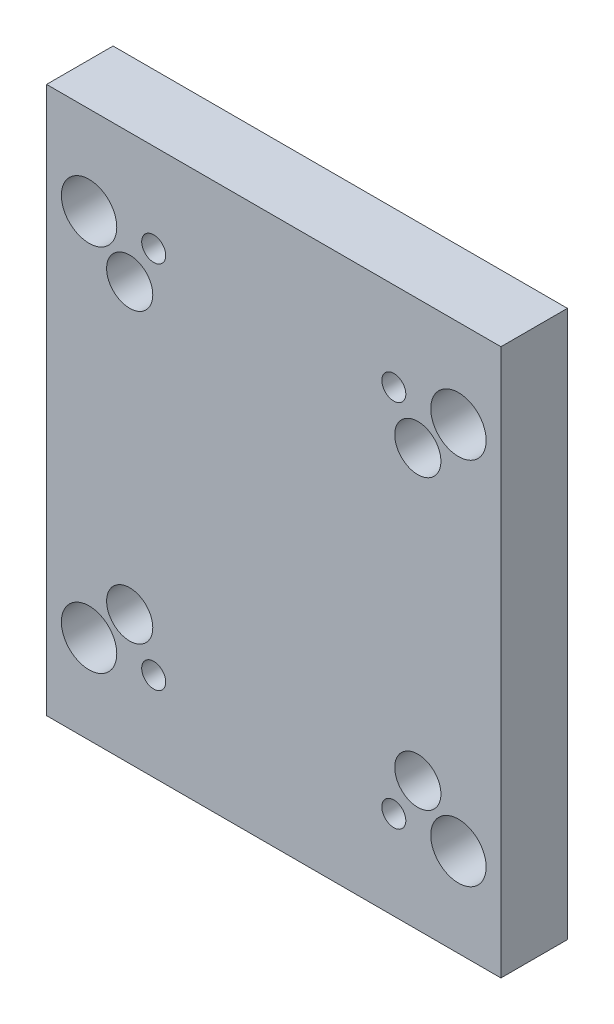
ISO-10303-21;
HEADER;
FILE_DESCRIPTION(('STEP AP214'),'2;1');
FILE_NAME('part.step','',(''),(''),'','','');
FILE_SCHEMA(('AUTOMOTIVE_DESIGN { 1 0 10303 214 1 1 1 1 }'));
ENDSEC;
DATA;
#1=APPLICATION_CONTEXT('core data for automotive mechanical design processes');
#2=APPLICATION_PROTOCOL_DEFINITION('international standard','automotive_design',2000,#1);
#3=PRODUCT_CONTEXT('',#1,'mechanical');
#4=PRODUCT('Part','Part','',(#3));
#5=PRODUCT_RELATED_PRODUCT_CATEGORY('part','',(#4));
#6=PRODUCT_DEFINITION_FORMATION('','',#4);
#7=PRODUCT_DEFINITION_CONTEXT('part definition',#1,'design');
#8=PRODUCT_DEFINITION('design','',#6,#7);
#9=PRODUCT_DEFINITION_SHAPE('','',#8);
#10=(LENGTH_UNIT() NAMED_UNIT(*) SI_UNIT(.MILLI.,.METRE.));
#11=(NAMED_UNIT(*) PLANE_ANGLE_UNIT() SI_UNIT($,.RADIAN.));
#12=(NAMED_UNIT(*) SI_UNIT($,.STERADIAN.) SOLID_ANGLE_UNIT());
#13=UNCERTAINTY_MEASURE_WITH_UNIT(LENGTH_MEASURE(1.E-05),#10,'distance_accuracy_value','');
#14=(GEOMETRIC_REPRESENTATION_CONTEXT(3) GLOBAL_UNCERTAINTY_ASSIGNED_CONTEXT((#13)) GLOBAL_UNIT_ASSIGNED_CONTEXT((#10,
#11,#12)) REPRESENTATION_CONTEXT('',''));
#15=CARTESIAN_POINT('',(0.,0.,0.));
#16=DIRECTION('',(0.,0.,1.));
#17=DIRECTION('',(1.,0.,0.));
#18=AXIS2_PLACEMENT_3D('',#15,#16,#17);
#19=CARTESIAN_POINT('',(0.,-128.,27.9999999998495));
#20=DIRECTION('',(0.,0.,-1.));
#21=DIRECTION('',(-1.,0.,0.));
#22=AXIS2_PLACEMENT_3D('',#19,#20,#21);
#23=CONICAL_SURFACE('',#22,2.45850000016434,1.04719755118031);
#24=CARTESIAN_POINT('',(0.,-128.,28.));
#25=DIRECTION('',(0.,0.,1.));
#26=DIRECTION('',(1.,0.,0.));
#27=AXIS2_PLACEMENT_3D('',#24,#25,#26);
#28=CIRCLE('',#27,2.4585);
#29=CARTESIAN_POINT('',(2.45849999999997,-128.,28.));
#30=VERTEX_POINT('',#29);
#31=EDGE_CURVE('E152',#30,#30,#28,.F.);
#32=ORIENTED_EDGE('',*,*,#31,.T.);
#33=EDGE_LOOP('',(#32));
#34=FACE_BOUND('',#33,.T.);
#35=CARTESIAN_POINT('',(8.52384793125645E-11,-127.999999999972,29.4194156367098));
#36=VERTEX_POINT('',#35);
#37=VERTEX_LOOP('',#36);
#38=FACE_BOUND('',#37,.T.);
#39=ADVANCED_FACE('F16',(#34,#38),#23,.F.);
#40=CARTESIAN_POINT('',(-103.,0.,28.0000000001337));
#41=DIRECTION('',(0.,0.,-1.));
#42=DIRECTION('',(0.,1.,0.));
#43=AXIS2_PLACEMENT_3D('',#40,#41,#42);
#44=CONICAL_SURFACE('',#43,2.45849999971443,1.04719755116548);
#45=CARTESIAN_POINT('',(-103.,0.,28.));
#46=DIRECTION('',(0.,0.,1.));
#47=DIRECTION('',(1.,0.,0.));
#48=AXIS2_PLACEMENT_3D('',#45,#46,#47);
#49=CIRCLE('',#48,2.4585);
#50=CARTESIAN_POINT('',(-100.5415,0.,28.));
#51=VERTEX_POINT('',#50);
#52=EDGE_CURVE('E149',#51,#51,#49,.F.);
#53=ORIENTED_EDGE('',*,*,#52,.T.);
#54=EDGE_LOOP('',(#53));
#55=FACE_BOUND('',#54,.T.);
#56=CARTESIAN_POINT('',(-103.,0.,29.4194156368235));
#57=VERTEX_POINT('',#56);
#58=VERTEX_LOOP('',#57);
#59=FACE_BOUND('',#58,.T.);
#60=ADVANCED_FACE('F62',(#55,#59),#44,.F.);
#61=CARTESIAN_POINT('',(103.,0.,28.0000000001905));
#62=DIRECTION('',(0.,0.,-1.));
#63=DIRECTION('',(-1.,0.,0.));
#64=AXIS2_PLACEMENT_3D('',#61,#62,#63);
#65=CONICAL_SURFACE('',#64,2.45849999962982,1.04719755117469);
#66=CARTESIAN_POINT('',(103.,0.,28.));
#67=DIRECTION('',(0.,0.,1.));
#68=DIRECTION('',(1.,0.,0.));
#69=AXIS2_PLACEMENT_3D('',#66,#67,#68);
#70=CIRCLE('',#69,2.4585);
#71=CARTESIAN_POINT('',(105.4585,0.,28.));
#72=VERTEX_POINT('',#71);
#73=EDGE_CURVE('E146',#72,#72,#70,.F.);
#74=ORIENTED_EDGE('',*,*,#73,.T.);
#75=EDGE_LOOP('',(#74));
#76=FACE_BOUND('',#75,.T.);
#77=CARTESIAN_POINT('',(103.,0.,29.4194156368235));
#78=VERTEX_POINT('',#77);
#79=VERTEX_LOOP('',#78);
#80=FACE_BOUND('',#79,.T.);
#81=ADVANCED_FACE('F69',(#76,#80),#65,.F.);
#82=CARTESIAN_POINT('',(0.,128.,27.9999999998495));
#83=DIRECTION('',(0.,0.,-1.));
#84=DIRECTION('',(-1.,0.,0.));
#85=AXIS2_PLACEMENT_3D('',#82,#83,#84);
#86=CONICAL_SURFACE('',#85,2.45850000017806,1.04719755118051);
#87=CARTESIAN_POINT('',(0.,128.,28.));
#88=DIRECTION('',(0.,0.,1.));
#89=DIRECTION('',(1.,0.,0.));
#90=AXIS2_PLACEMENT_3D('',#87,#88,#89);
#91=CIRCLE('',#90,2.4585);
#92=CARTESIAN_POINT('',(2.45849999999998,128.,28.));
#93=VERTEX_POINT('',#92);
#94=EDGE_CURVE('E143',#93,#93,#91,.F.);
#95=ORIENTED_EDGE('',*,*,#94,.T.);
#96=EDGE_LOOP('',(#95));
#97=FACE_BOUND('',#96,.T.);
#98=CARTESIAN_POINT('',(0.,128.,29.4194156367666));
#99=VERTEX_POINT('',#98);
#100=VERTEX_LOOP('',#99);
#101=FACE_BOUND('',#100,.T.);
#102=ADVANCED_FACE('F383',(#97,#101),#86,.F.);
#103=CARTESIAN_POINT('',(0.,-128.,0.1));
#104=DIRECTION('',(0.,0.,1.));
#105=DIRECTION('',(1.,0.,0.));
#106=AXIS2_PLACEMENT_3D('',#103,#104,#105);
#107=CYLINDRICAL_SURFACE('',#106,2.4585);
#108=ORIENTED_EDGE('',*,*,#31,.F.);
#109=EDGE_LOOP('',(#108));
#110=FACE_BOUND('',#109,.T.);
#111=CARTESIAN_POINT('',(0.,-128.,0.));
#112=DIRECTION('',(0.,0.,1.));
#113=DIRECTION('',(1.,0.,0.));
#114=AXIS2_PLACEMENT_3D('',#111,#112,#113);
#115=CIRCLE('',#114,2.4585);
#116=CARTESIAN_POINT('',(2.45849999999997,-128.,0.));
#117=VERTEX_POINT('',#116);
#118=EDGE_CURVE('E222',#117,#117,#115,.F.);
#119=ORIENTED_EDGE('',*,*,#118,.T.);
#120=EDGE_LOOP('',(#119));
#121=FACE_BOUND('',#120,.T.);
#122=ADVANCED_FACE('F381',(#110,#121),#107,.F.);
#123=CARTESIAN_POINT('',(-65.,100.,0.1));
#124=DIRECTION('',(0.,0.,1.));
#125=DIRECTION('',(1.,0.,0.));
#126=AXIS2_PLACEMENT_3D('',#123,#124,#125);
#127=CYLINDRICAL_SURFACE('',#126,10.);
#128=CARTESIAN_POINT('',(-65.,100.,15.5));
#129=DIRECTION('',(0.,0.,1.));
#130=DIRECTION('',(1.,0.,0.));
#131=AXIS2_PLACEMENT_3D('',#128,#129,#130);
#132=CIRCLE('',#131,10.);
#133=CARTESIAN_POINT('',(-55.,100.,15.5));
#134=VERTEX_POINT('',#133);
#135=EDGE_CURVE('E20',#134,#134,#132,.T.);
#136=ORIENTED_EDGE('',*,*,#135,.T.);
#137=EDGE_LOOP('',(#136));
#138=FACE_BOUND('',#137,.T.);
#139=CARTESIAN_POINT('',(-65.,100.,0.));
#140=DIRECTION('',(0.,0.,1.));
#141=DIRECTION('',(1.,0.,0.));
#142=AXIS2_PLACEMENT_3D('',#139,#140,#141);
#143=CIRCLE('',#142,10.);
#144=CARTESIAN_POINT('',(-55.,100.,0.));
#145=VERTEX_POINT('',#144);
#146=EDGE_CURVE('E219',#145,#145,#143,.F.);
#147=ORIENTED_EDGE('',*,*,#146,.T.);
#148=EDGE_LOOP('',(#147));
#149=FACE_BOUND('',#148,.T.);
#150=ADVANCED_FACE('F237',(#138,#149),#127,.F.);
#151=CARTESIAN_POINT('',(-65.,-100.,0.1));
#152=DIRECTION('',(0.,0.,1.));
#153=DIRECTION('',(1.,0.,0.));
#154=AXIS2_PLACEMENT_3D('',#151,#152,#153);
#155=CYLINDRICAL_SURFACE('',#154,10.);
#156=CARTESIAN_POINT('',(-65.,-100.,15.5));
#157=DIRECTION('',(0.,0.,1.));
#158=DIRECTION('',(1.,0.,0.));
#159=AXIS2_PLACEMENT_3D('',#156,#157,#158);
#160=CIRCLE('',#159,10.);
#161=CARTESIAN_POINT('',(-55.,-100.,15.5));
#162=VERTEX_POINT('',#161);
#163=EDGE_CURVE('E230',#162,#162,#160,.T.);
#164=ORIENTED_EDGE('',*,*,#163,.T.);
#165=EDGE_LOOP('',(#164));
#166=FACE_BOUND('',#165,.T.);
#167=CARTESIAN_POINT('',(-65.,-100.,0.));
#168=DIRECTION('',(0.,0.,1.));
#169=DIRECTION('',(1.,0.,0.));
#170=AXIS2_PLACEMENT_3D('',#167,#168,#169);
#171=CIRCLE('',#170,10.);
#172=CARTESIAN_POINT('',(-55.,-100.,0.));
#173=VERTEX_POINT('',#172);
#174=EDGE_CURVE('E216',#173,#173,#171,.F.);
#175=ORIENTED_EDGE('',*,*,#174,.T.);
#176=EDGE_LOOP('',(#175));
#177=FACE_BOUND('',#176,.T.);
#178=ADVANCED_FACE('F390',(#166,#177),#155,.F.);
#179=CARTESIAN_POINT('',(65.,100.,0.1));
#180=DIRECTION('',(0.,0.,1.));
#181=DIRECTION('',(1.,0.,0.));
#182=AXIS2_PLACEMENT_3D('',#179,#180,#181);
#183=CYLINDRICAL_SURFACE('',#182,10.);
#184=CARTESIAN_POINT('',(65.,100.,15.5));
#185=DIRECTION('',(0.,0.,1.));
#186=DIRECTION('',(1.,0.,0.));
#187=AXIS2_PLACEMENT_3D('',#184,#185,#186);
#188=CIRCLE('',#187,10.);
#189=CARTESIAN_POINT('',(75.,100.,15.5));
#190=VERTEX_POINT('',#189);
#191=EDGE_CURVE('E228',#190,#190,#188,.T.);
#192=ORIENTED_EDGE('',*,*,#191,.T.);
#193=EDGE_LOOP('',(#192));
#194=FACE_BOUND('',#193,.T.);
#195=CARTESIAN_POINT('',(65.,100.,0.));
#196=DIRECTION('',(0.,0.,1.));
#197=DIRECTION('',(1.,0.,0.));
#198=AXIS2_PLACEMENT_3D('',#195,#196,#197);
#199=CIRCLE('',#198,10.);
#200=CARTESIAN_POINT('',(75.,100.,0.));
#201=VERTEX_POINT('',#200);
#202=EDGE_CURVE('E213',#201,#201,#199,.F.);
#203=ORIENTED_EDGE('',*,*,#202,.T.);
#204=EDGE_LOOP('',(#203));
#205=FACE_BOUND('',#204,.T.);
#206=ADVANCED_FACE('F399',(#194,#205),#183,.F.);
#207=CARTESIAN_POINT('',(65.,-100.,0.1));
#208=DIRECTION('',(0.,0.,1.));
#209=DIRECTION('',(1.,0.,0.));
#210=AXIS2_PLACEMENT_3D('',#207,#208,#209);
#211=CYLINDRICAL_SURFACE('',#210,10.);
#212=CARTESIAN_POINT('',(65.,-100.,15.5));
#213=DIRECTION('',(0.,0.,1.));
#214=DIRECTION('',(1.,0.,0.));
#215=AXIS2_PLACEMENT_3D('',#212,#213,#214);
#216=CIRCLE('',#215,10.);
#217=CARTESIAN_POINT('',(75.,-100.,15.5));
#218=VERTEX_POINT('',#217);
#219=EDGE_CURVE('E225',#218,#218,#216,.T.);
#220=ORIENTED_EDGE('',*,*,#219,.T.);
#221=EDGE_LOOP('',(#220));
#222=FACE_BOUND('',#221,.T.);
#223=CARTESIAN_POINT('',(65.,-100.,0.));
#224=DIRECTION('',(0.,0.,1.));
#225=DIRECTION('',(1.,0.,0.));
#226=AXIS2_PLACEMENT_3D('',#223,#224,#225);
#227=CIRCLE('',#226,10.);
#228=CARTESIAN_POINT('',(75.,-100.,0.));
#229=VERTEX_POINT('',#228);
#230=EDGE_CURVE('E210',#229,#229,#227,.F.);
#231=ORIENTED_EDGE('',*,*,#230,.T.);
#232=EDGE_LOOP('',(#231));
#233=FACE_BOUND('',#232,.T.);
#234=ADVANCED_FACE('F402',(#222,#233),#211,.F.);
#235=CARTESIAN_POINT('',(-103.,0.,0.1));
#236=DIRECTION('',(0.,0.,1.));
#237=DIRECTION('',(1.,0.,0.));
#238=AXIS2_PLACEMENT_3D('',#235,#236,#237);
#239=CYLINDRICAL_SURFACE('',#238,2.4585);
#240=ORIENTED_EDGE('',*,*,#52,.F.);
#241=EDGE_LOOP('',(#240));
#242=FACE_BOUND('',#241,.T.);
#243=CARTESIAN_POINT('',(-103.,0.,0.));
#244=DIRECTION('',(0.,0.,1.));
#245=DIRECTION('',(1.,0.,0.));
#246=AXIS2_PLACEMENT_3D('',#243,#244,#245);
#247=CIRCLE('',#246,2.4585);
#248=CARTESIAN_POINT('',(-100.5415,0.,0.));
#249=VERTEX_POINT('',#248);
#250=EDGE_CURVE('E207',#249,#249,#247,.F.);
#251=ORIENTED_EDGE('',*,*,#250,.T.);
#252=EDGE_LOOP('',(#251));
#253=FACE_BOUND('',#252,.T.);
#254=ADVANCED_FACE('F406',(#242,#253),#239,.F.);
#255=CARTESIAN_POINT('',(103.,0.,0.1));
#256=DIRECTION('',(0.,0.,1.));
#257=DIRECTION('',(1.,0.,0.));
#258=AXIS2_PLACEMENT_3D('',#255,#256,#257);
#259=CYLINDRICAL_SURFACE('',#258,2.4585);
#260=ORIENTED_EDGE('',*,*,#73,.F.);
#261=EDGE_LOOP('',(#260));
#262=FACE_BOUND('',#261,.T.);
#263=CARTESIAN_POINT('',(103.,0.,0.));
#264=DIRECTION('',(0.,0.,1.));
#265=DIRECTION('',(1.,0.,0.));
#266=AXIS2_PLACEMENT_3D('',#263,#264,#265);
#267=CIRCLE('',#266,2.4585);
#268=CARTESIAN_POINT('',(105.4585,0.,0.));
#269=VERTEX_POINT('',#268);
#270=EDGE_CURVE('E204',#269,#269,#267,.F.);
#271=ORIENTED_EDGE('',*,*,#270,.T.);
#272=EDGE_LOOP('',(#271));
#273=FACE_BOUND('',#272,.T.);
#274=ADVANCED_FACE('F253',(#262,#273),#259,.F.);
#275=CARTESIAN_POINT('',(0.,128.,0.1));
#276=DIRECTION('',(0.,0.,1.));
#277=DIRECTION('',(1.,0.,0.));
#278=AXIS2_PLACEMENT_3D('',#275,#276,#277);
#279=CYLINDRICAL_SURFACE('',#278,2.4585);
#280=ORIENTED_EDGE('',*,*,#94,.F.);
#281=EDGE_LOOP('',(#280));
#282=FACE_BOUND('',#281,.T.);
#283=CARTESIAN_POINT('',(0.,128.,0.));
#284=DIRECTION('',(0.,0.,1.));
#285=DIRECTION('',(1.,0.,0.));
#286=AXIS2_PLACEMENT_3D('',#283,#284,#285);
#287=CIRCLE('',#286,2.4585);
#288=CARTESIAN_POINT('',(2.45849999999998,128.,0.));
#289=VERTEX_POINT('',#288);
#290=EDGE_CURVE('E200',#289,#289,#287,.F.);
#291=ORIENTED_EDGE('',*,*,#290,.T.);
#292=EDGE_LOOP('',(#291));
#293=FACE_BOUND('',#292,.T.);
#294=ADVANCED_FACE('F243',(#282,#293),#279,.F.);
#295=CARTESIAN_POINT('',(65.,-106.5,15.5));
#296=DIRECTION('',(0.,0.,1.));
#297=DIRECTION('',(1.,0.,0.));
#298=AXIS2_PLACEMENT_3D('',#295,#296,#297);
#299=PLANE('',#298);
#300=CARTESIAN_POINT('',(-65.,100.,15.5));
#301=DIRECTION('',(0.,0.,1.));
#302=DIRECTION('',(1.,0.,0.));
#303=AXIS2_PLACEMENT_3D('',#300,#301,#302);
#304=CIRCLE('',#303,6.5);
#305=CARTESIAN_POINT('',(-58.5,100.,15.5));
#306=VERTEX_POINT('',#305);
#307=EDGE_CURVE('E197',#306,#306,#304,.T.);
#308=ORIENTED_EDGE('',*,*,#307,.T.);
#309=EDGE_LOOP('',(#308));
#310=FACE_BOUND('',#309,.T.);
#311=ORIENTED_EDGE('',*,*,#135,.F.);
#312=EDGE_LOOP('',(#311));
#313=FACE_BOUND('',#312,.T.);
#314=ADVANCED_FACE('F240',(#310,#313),#299,.F.);
#315=CARTESIAN_POINT('',(65.,-106.5,15.5));
#316=DIRECTION('',(0.,0.,1.));
#317=DIRECTION('',(1.,0.,0.));
#318=AXIS2_PLACEMENT_3D('',#315,#316,#317);
#319=PLANE('',#318);
#320=CARTESIAN_POINT('',(-65.,-100.,15.5));
#321=DIRECTION('',(0.,0.,1.));
#322=DIRECTION('',(1.,0.,0.));
#323=AXIS2_PLACEMENT_3D('',#320,#321,#322);
#324=CIRCLE('',#323,6.5);
#325=CARTESIAN_POINT('',(-58.5,-100.,15.5));
#326=VERTEX_POINT('',#325);
#327=EDGE_CURVE('E194',#326,#326,#324,.T.);
#328=ORIENTED_EDGE('',*,*,#327,.T.);
#329=EDGE_LOOP('',(#328));
#330=FACE_BOUND('',#329,.T.);
#331=ORIENTED_EDGE('',*,*,#163,.F.);
#332=EDGE_LOOP('',(#331));
#333=FACE_BOUND('',#332,.T.);
#334=ADVANCED_FACE('F242',(#330,#333),#319,.F.);
#335=CARTESIAN_POINT('',(65.,-106.5,15.5));
#336=DIRECTION('',(0.,0.,1.));
#337=DIRECTION('',(1.,0.,0.));
#338=AXIS2_PLACEMENT_3D('',#335,#336,#337);
#339=PLANE('',#338);
#340=CARTESIAN_POINT('',(65.,100.,15.5));
#341=DIRECTION('',(0.,0.,1.));
#342=DIRECTION('',(1.,0.,0.));
#343=AXIS2_PLACEMENT_3D('',#340,#341,#342);
#344=CIRCLE('',#343,6.5);
#345=CARTESIAN_POINT('',(71.5,100.,15.5));
#346=VERTEX_POINT('',#345);
#347=EDGE_CURVE('E191',#346,#346,#344,.T.);
#348=ORIENTED_EDGE('',*,*,#347,.T.);
#349=EDGE_LOOP('',(#348));
#350=FACE_BOUND('',#349,.T.);
#351=ORIENTED_EDGE('',*,*,#191,.F.);
#352=EDGE_LOOP('',(#351));
#353=FACE_BOUND('',#352,.T.);
#354=ADVANCED_FACE('F250',(#350,#353),#339,.F.);
#355=CARTESIAN_POINT('',(65.,-106.5,15.5));
#356=DIRECTION('',(0.,0.,1.));
#357=DIRECTION('',(1.,0.,0.));
#358=AXIS2_PLACEMENT_3D('',#355,#356,#357);
#359=PLANE('',#358);
#360=CARTESIAN_POINT('',(65.,-100.,15.5));
#361=DIRECTION('',(0.,0.,1.));
#362=DIRECTION('',(1.,0.,0.));
#363=AXIS2_PLACEMENT_3D('',#360,#361,#362);
#364=CIRCLE('',#363,6.5);
#365=CARTESIAN_POINT('',(71.5,-100.,15.5));
#366=VERTEX_POINT('',#365);
#367=EDGE_CURVE('E188',#366,#366,#364,.T.);
#368=ORIENTED_EDGE('',*,*,#367,.T.);
#369=EDGE_LOOP('',(#368));
#370=FACE_BOUND('',#369,.T.);
#371=ORIENTED_EDGE('',*,*,#219,.F.);
#372=EDGE_LOOP('',(#371));
#373=FACE_BOUND('',#372,.T.);
#374=ADVANCED_FACE('F260',(#370,#373),#359,.F.);
#375=CARTESIAN_POINT('',(0.,0.,0.));
#376=DIRECTION('',(0.,0.,1.));
#377=DIRECTION('',(1.,0.,0.));
#378=AXIS2_PLACEMENT_3D('',#375,#376,#377);
#379=PLANE('',#378);
#380=ORIENTED_EDGE('',*,*,#290,.F.);
#381=EDGE_LOOP('',(#380));
#382=FACE_BOUND('',#381,.T.);
#383=ORIENTED_EDGE('',*,*,#270,.F.);
#384=EDGE_LOOP('',(#383));
#385=FACE_BOUND('',#384,.T.);
#386=ORIENTED_EDGE('',*,*,#250,.F.);
#387=EDGE_LOOP('',(#386));
#388=FACE_BOUND('',#387,.T.);
#389=CARTESIAN_POINT('',(78.,78.,0.));
#390=DIRECTION('',(0.,0.,1.));
#391=DIRECTION('',(1.,0.,0.));
#392=AXIS2_PLACEMENT_3D('',#389,#390,#391);
#393=CIRCLE('',#392,12.5);
#394=CARTESIAN_POINT('',(90.5,78.,0.));
#395=VERTEX_POINT('',#394);
#396=EDGE_CURVE('E142',#395,#395,#393,.T.);
#397=ORIENTED_EDGE('',*,*,#396,.T.);
#398=EDGE_LOOP('',(#397));
#399=FACE_BOUND('',#398,.T.);
#400=CARTESIAN_POINT('',(-78.,78.,0.));
#401=DIRECTION('',(0.,0.,1.));
#402=DIRECTION('',(1.,0.,0.));
#403=AXIS2_PLACEMENT_3D('',#400,#401,#402);
#404=CIRCLE('',#403,12.5);
#405=CARTESIAN_POINT('',(-65.5,78.,0.));
#406=VERTEX_POINT('',#405);
#407=EDGE_CURVE('E167',#406,#406,#404,.T.);
#408=ORIENTED_EDGE('',*,*,#407,.T.);
#409=EDGE_LOOP('',(#408));
#410=FACE_BOUND('',#409,.T.);
#411=CARTESIAN_POINT('',(-78.,-78.,0.));
#412=DIRECTION('',(0.,0.,1.));
#413=DIRECTION('',(1.,0.,0.));
#414=AXIS2_PLACEMENT_3D('',#411,#412,#413);
#415=CIRCLE('',#414,12.5);
#416=CARTESIAN_POINT('',(-65.5,-78.,0.));
#417=VERTEX_POINT('',#416);
#418=EDGE_CURVE('E170',#417,#417,#415,.T.);
#419=ORIENTED_EDGE('',*,*,#418,.T.);
#420=EDGE_LOOP('',(#419));
#421=FACE_BOUND('',#420,.T.);
#422=CARTESIAN_POINT('',(100.,100.,0.));
#423=DIRECTION('',(0.,0.,1.));
#424=DIRECTION('',(1.,0.,0.));
#425=AXIS2_PLACEMENT_3D('',#422,#423,#424);
#426=CIRCLE('',#425,15.);
#427=CARTESIAN_POINT('',(115.,100.,0.));
#428=VERTEX_POINT('',#427);
#429=EDGE_CURVE('E173',#428,#428,#426,.T.);
#430=ORIENTED_EDGE('',*,*,#429,.T.);
#431=EDGE_LOOP('',(#430));
#432=FACE_BOUND('',#431,.T.);
#433=CARTESIAN_POINT('',(-100.,100.,0.));
#434=DIRECTION('',(0.,0.,1.));
#435=DIRECTION('',(1.,0.,0.));
#436=AXIS2_PLACEMENT_3D('',#433,#434,#435);
#437=CIRCLE('',#436,15.);
#438=CARTESIAN_POINT('',(-85.,100.,0.));
#439=VERTEX_POINT('',#438);
#440=EDGE_CURVE('E176',#439,#439,#437,.T.);
#441=ORIENTED_EDGE('',*,*,#440,.T.);
#442=EDGE_LOOP('',(#441));
#443=FACE_BOUND('',#442,.T.);
#444=CARTESIAN_POINT('',(-100.,-100.,0.));
#445=DIRECTION('',(0.,0.,1.));
#446=DIRECTION('',(1.,0.,0.));
#447=AXIS2_PLACEMENT_3D('',#444,#445,#446);
#448=CIRCLE('',#447,15.);
#449=CARTESIAN_POINT('',(-85.,-100.,0.));
#450=VERTEX_POINT('',#449);
#451=EDGE_CURVE('E179',#450,#450,#448,.T.);
#452=ORIENTED_EDGE('',*,*,#451,.T.);
#453=EDGE_LOOP('',(#452));
#454=FACE_BOUND('',#453,.T.);
#455=CARTESIAN_POINT('',(100.,-100.,0.));
#456=DIRECTION('',(0.,0.,1.));
#457=DIRECTION('',(1.,0.,0.));
#458=AXIS2_PLACEMENT_3D('',#455,#456,#457);
#459=CIRCLE('',#458,15.);
#460=CARTESIAN_POINT('',(115.,-100.,0.));
#461=VERTEX_POINT('',#460);
#462=EDGE_CURVE('E182',#461,#461,#459,.T.);
#463=ORIENTED_EDGE('',*,*,#462,.T.);
#464=EDGE_LOOP('',(#463));
#465=FACE_BOUND('',#464,.T.);
#466=CARTESIAN_POINT('',(78.,-78.,0.));
#467=DIRECTION('',(0.,0.,1.));
#468=DIRECTION('',(1.,0.,0.));
#469=AXIS2_PLACEMENT_3D('',#466,#467,#468);
#470=CIRCLE('',#469,12.5);
#471=CARTESIAN_POINT('',(90.5,-78.,0.));
#472=VERTEX_POINT('',#471);
#473=EDGE_CURVE('E185',#472,#472,#470,.T.);
#474=ORIENTED_EDGE('',*,*,#473,.T.);
#475=EDGE_LOOP('',(#474));
#476=FACE_BOUND('',#475,.T.);
#477=ORIENTED_EDGE('',*,*,#230,.F.);
#478=EDGE_LOOP('',(#477));
#479=FACE_BOUND('',#478,.T.);
#480=ORIENTED_EDGE('',*,*,#202,.F.);
#481=EDGE_LOOP('',(#480));
#482=FACE_BOUND('',#481,.T.);
#483=ORIENTED_EDGE('',*,*,#174,.F.);
#484=EDGE_LOOP('',(#483));
#485=FACE_BOUND('',#484,.T.);
#486=ORIENTED_EDGE('',*,*,#146,.F.);
#487=EDGE_LOOP('',(#486));
#488=FACE_BOUND('',#487,.T.);
#489=ORIENTED_EDGE('',*,*,#118,.F.);
#490=EDGE_LOOP('',(#489));
#491=FACE_BOUND('',#490,.T.);
#492=DIRECTION('',(0.,1.,0.));
#493=VECTOR('',#492,1.);
#494=CARTESIAN_POINT('',(-123.,-148.,0.));
#495=LINE('',#494,#493);
#496=CARTESIAN_POINT('',(-123.,-148.,0.));
#497=VERTEX_POINT('',#496);
#498=CARTESIAN_POINT('',(-123.,148.,0.));
#499=VERTEX_POINT('',#498);
#500=EDGE_CURVE('E358',#497,#499,#495,.T.);
#501=ORIENTED_EDGE('',*,*,#500,.T.);
#502=DIRECTION('',(1.,0.,0.));
#503=VECTOR('',#502,1.);
#504=CARTESIAN_POINT('',(-123.,148.,0.));
#505=LINE('',#504,#503);
#506=CARTESIAN_POINT('',(123.,148.,0.));
#507=VERTEX_POINT('',#506);
#508=EDGE_CURVE('E361',#499,#507,#505,.T.);
#509=ORIENTED_EDGE('',*,*,#508,.T.);
#510=DIRECTION('',(0.,-1.,0.));
#511=VECTOR('',#510,1.);
#512=CARTESIAN_POINT('',(123.,148.,0.));
#513=LINE('',#512,#511);
#514=CARTESIAN_POINT('',(123.,-148.,0.));
#515=VERTEX_POINT('',#514);
#516=EDGE_CURVE('E203',#507,#515,#513,.T.);
#517=ORIENTED_EDGE('',*,*,#516,.T.);
#518=DIRECTION('',(-1.,0.,0.));
#519=VECTOR('',#518,1.);
#520=CARTESIAN_POINT('',(123.,-148.,0.));
#521=LINE('',#520,#519);
#522=EDGE_CURVE('E364',#515,#497,#521,.T.);
#523=ORIENTED_EDGE('',*,*,#522,.T.);
#524=EDGE_LOOP('',(#501,#509,#517,#523));
#525=FACE_BOUND('',#524,.T.);
#526=ADVANCED_FACE('F264',(#382,#385,#388,#399,#410,#421,#432,#443,#454,#465,#476,#479,#482,
#485,#488,#491,#525),#379,.F.);
#527=CARTESIAN_POINT('',(123.,148.,0.));
#528=DIRECTION('',(-1.,0.,0.));
#529=DIRECTION('',(0.,-1.,0.));
#530=AXIS2_PLACEMENT_3D('',#527,#528,#529);
#531=PLANE('',#530);
#532=ORIENTED_EDGE('',*,*,#516,.F.);
#533=DIRECTION('',(0.,0.,1.));
#534=VECTOR('',#533,1.);
#535=CARTESIAN_POINT('',(123.,148.,0.));
#536=LINE('',#535,#534);
#537=CARTESIAN_POINT('',(123.,148.,36.));
#538=VERTEX_POINT('',#537);
#539=EDGE_CURVE('E367',#507,#538,#536,.T.);
#540=ORIENTED_EDGE('',*,*,#539,.T.);
#541=DIRECTION('',(0.,1.,0.));
#542=VECTOR('',#541,1.);
#543=CARTESIAN_POINT('',(123.,0.,36.));
#544=LINE('',#543,#542);
#545=CARTESIAN_POINT('',(123.,-148.,36.));
#546=VERTEX_POINT('',#545);
#547=EDGE_CURVE('E137',#546,#538,#544,.T.);
#548=ORIENTED_EDGE('',*,*,#547,.F.);
#549=DIRECTION('',(0.,0.,1.));
#550=VECTOR('',#549,1.);
#551=CARTESIAN_POINT('',(123.,-148.,0.));
#552=LINE('',#551,#550);
#553=EDGE_CURVE('E371',#546,#515,#552,.F.);
#554=ORIENTED_EDGE('',*,*,#553,.T.);
#555=EDGE_LOOP('',(#532,#540,#548,#554));
#556=FACE_BOUND('',#555,.T.);
#557=ADVANCED_FACE('F268',(#556),#531,.F.);
#558=CARTESIAN_POINT('',(-123.,148.,0.));
#559=DIRECTION('',(0.,-1.,0.));
#560=DIRECTION('',(1.,0.,0.));
#561=AXIS2_PLACEMENT_3D('',#558,#559,#560);
#562=PLANE('',#561);
#563=ORIENTED_EDGE('',*,*,#508,.F.);
#564=DIRECTION('',(0.,0.,1.));
#565=VECTOR('',#564,1.);
#566=CARTESIAN_POINT('',(-123.,148.,0.));
#567=LINE('',#566,#565);
#568=CARTESIAN_POINT('',(-123.,148.,36.));
#569=VERTEX_POINT('',#568);
#570=EDGE_CURVE('E366',#499,#569,#567,.T.);
#571=ORIENTED_EDGE('',*,*,#570,.T.);
#572=DIRECTION('',(1.,0.,0.));
#573=VECTOR('',#572,1.);
#574=CARTESIAN_POINT('',(0.,148.,36.));
#575=LINE('',#574,#573);
#576=EDGE_CURVE('E133',#538,#569,#575,.F.);
#577=ORIENTED_EDGE('',*,*,#576,.F.);
#578=ORIENTED_EDGE('',*,*,#539,.F.);
#579=EDGE_LOOP('',(#563,#571,#577,#578));
#580=FACE_BOUND('',#579,.T.);
#581=ADVANCED_FACE('F272',(#580),#562,.F.);
#582=CARTESIAN_POINT('',(-123.,-148.,0.));
#583=DIRECTION('',(1.,0.,0.));
#584=DIRECTION('',(0.,1.,0.));
#585=AXIS2_PLACEMENT_3D('',#582,#583,#584);
#586=PLANE('',#585);
#587=ORIENTED_EDGE('',*,*,#500,.F.);
#588=DIRECTION('',(0.,0.,1.));
#589=VECTOR('',#588,1.);
#590=CARTESIAN_POINT('',(-123.,-148.,0.));
#591=LINE('',#590,#589);
#592=CARTESIAN_POINT('',(-123.,-148.,36.));
#593=VERTEX_POINT('',#592);
#594=EDGE_CURVE('E35',#497,#593,#591,.T.);
#595=ORIENTED_EDGE('',*,*,#594,.T.);
#596=DIRECTION('',(0.,1.,0.));
#597=VECTOR('',#596,1.);
#598=CARTESIAN_POINT('',(-123.,0.,36.));
#599=LINE('',#598,#597);
#600=EDGE_CURVE('E129',#569,#593,#599,.F.);
#601=ORIENTED_EDGE('',*,*,#600,.F.);
#602=ORIENTED_EDGE('',*,*,#570,.F.);
#603=EDGE_LOOP('',(#587,#595,#601,#602));
#604=FACE_BOUND('',#603,.T.);
#605=ADVANCED_FACE('F276',(#604),#586,.F.);
#606=CARTESIAN_POINT('',(123.,-148.,0.));
#607=DIRECTION('',(0.,1.,0.));
#608=DIRECTION('',(-1.,0.,0.));
#609=AXIS2_PLACEMENT_3D('',#606,#607,#608);
#610=PLANE('',#609);
#611=ORIENTED_EDGE('',*,*,#522,.F.);
#612=ORIENTED_EDGE('',*,*,#553,.F.);
#613=DIRECTION('',(1.,0.,0.));
#614=VECTOR('',#613,1.);
#615=CARTESIAN_POINT('',(0.,-148.,36.));
#616=LINE('',#615,#614);
#617=EDGE_CURVE('E131',#593,#546,#616,.T.);
#618=ORIENTED_EDGE('',*,*,#617,.F.);
#619=ORIENTED_EDGE('',*,*,#594,.F.);
#620=EDGE_LOOP('',(#611,#612,#618,#619));
#621=FACE_BOUND('',#620,.T.);
#622=ADVANCED_FACE('F280',(#621),#610,.F.);
#623=CARTESIAN_POINT('',(-65.,100.,0.1));
#624=DIRECTION('',(0.,0.,1.));
#625=DIRECTION('',(1.,0.,0.));
#626=AXIS2_PLACEMENT_3D('',#623,#624,#625);
#627=CYLINDRICAL_SURFACE('',#626,6.5);
#628=ORIENTED_EDGE('',*,*,#307,.F.);
#629=EDGE_LOOP('',(#628));
#630=FACE_BOUND('',#629,.T.);
#631=CARTESIAN_POINT('',(-65.,100.,36.));
#632=DIRECTION('',(0.,0.,1.));
#633=DIRECTION('',(1.,0.,0.));
#634=AXIS2_PLACEMENT_3D('',#631,#632,#633);
#635=CIRCLE('',#634,6.5);
#636=CARTESIAN_POINT('',(-58.5,100.,36.));
#637=VERTEX_POINT('',#636);
#638=EDGE_CURVE('E125',#637,#637,#635,.F.);
#639=ORIENTED_EDGE('',*,*,#638,.F.);
#640=EDGE_LOOP('',(#639));
#641=FACE_BOUND('',#640,.T.);
#642=ADVANCED_FACE('F283',(#630,#641),#627,.F.);
#643=CARTESIAN_POINT('',(-65.,-100.,0.1));
#644=DIRECTION('',(0.,0.,1.));
#645=DIRECTION('',(1.,0.,0.));
#646=AXIS2_PLACEMENT_3D('',#643,#644,#645);
#647=CYLINDRICAL_SURFACE('',#646,6.5);
#648=ORIENTED_EDGE('',*,*,#327,.F.);
#649=EDGE_LOOP('',(#648));
#650=FACE_BOUND('',#649,.T.);
#651=CARTESIAN_POINT('',(-65.,-100.,36.));
#652=DIRECTION('',(0.,0.,1.));
#653=DIRECTION('',(1.,0.,0.));
#654=AXIS2_PLACEMENT_3D('',#651,#652,#653);
#655=CIRCLE('',#654,6.5);
#656=CARTESIAN_POINT('',(-58.5,-100.,36.));
#657=VERTEX_POINT('',#656);
#658=EDGE_CURVE('E121',#657,#657,#655,.F.);
#659=ORIENTED_EDGE('',*,*,#658,.F.);
#660=EDGE_LOOP('',(#659));
#661=FACE_BOUND('',#660,.T.);
#662=ADVANCED_FACE('F287',(#650,#661),#647,.F.);
#663=CARTESIAN_POINT('',(65.,100.,0.1));
#664=DIRECTION('',(0.,0.,1.));
#665=DIRECTION('',(1.,0.,0.));
#666=AXIS2_PLACEMENT_3D('',#663,#664,#665);
#667=CYLINDRICAL_SURFACE('',#666,6.5);
#668=ORIENTED_EDGE('',*,*,#347,.F.);
#669=EDGE_LOOP('',(#668));
#670=FACE_BOUND('',#669,.T.);
#671=CARTESIAN_POINT('',(65.,100.,36.));
#672=DIRECTION('',(0.,0.,1.));
#673=DIRECTION('',(1.,0.,0.));
#674=AXIS2_PLACEMENT_3D('',#671,#672,#673);
#675=CIRCLE('',#674,6.5);
#676=CARTESIAN_POINT('',(71.5,100.,36.));
#677=VERTEX_POINT('',#676);
#678=EDGE_CURVE('E117',#677,#677,#675,.F.);
#679=ORIENTED_EDGE('',*,*,#678,.F.);
#680=EDGE_LOOP('',(#679));
#681=FACE_BOUND('',#680,.T.);
#682=ADVANCED_FACE('F291',(#670,#681),#667,.F.);
#683=CARTESIAN_POINT('',(65.,-100.,0.1));
#684=DIRECTION('',(0.,0.,1.));
#685=DIRECTION('',(1.,0.,0.));
#686=AXIS2_PLACEMENT_3D('',#683,#684,#685);
#687=CYLINDRICAL_SURFACE('',#686,6.5);
#688=ORIENTED_EDGE('',*,*,#367,.F.);
#689=EDGE_LOOP('',(#688));
#690=FACE_BOUND('',#689,.T.);
#691=CARTESIAN_POINT('',(65.,-100.,36.));
#692=DIRECTION('',(0.,0.,1.));
#693=DIRECTION('',(1.,0.,0.));
#694=AXIS2_PLACEMENT_3D('',#691,#692,#693);
#695=CIRCLE('',#694,6.5);
#696=CARTESIAN_POINT('',(71.5,-100.,36.));
#697=VERTEX_POINT('',#696);
#698=EDGE_CURVE('E113',#697,#697,#695,.F.);
#699=ORIENTED_EDGE('',*,*,#698,.F.);
#700=EDGE_LOOP('',(#699));
#701=FACE_BOUND('',#700,.T.);
#702=ADVANCED_FACE('F295',(#690,#701),#687,.F.);
#703=CARTESIAN_POINT('',(78.,-78.,18.6600000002));
#704=DIRECTION('',(0.,0.,1.));
#705=DIRECTION('',(1.,0.,0.));
#706=AXIS2_PLACEMENT_3D('',#703,#704,#705);
#707=CYLINDRICAL_SURFACE('',#706,12.5);
#708=ORIENTED_EDGE('',*,*,#473,.F.);
#709=EDGE_LOOP('',(#708));
#710=FACE_BOUND('',#709,.T.);
#711=CARTESIAN_POINT('',(78.,-78.,36.));
#712=DIRECTION('',(0.,0.,1.));
#713=DIRECTION('',(1.,0.,0.));
#714=AXIS2_PLACEMENT_3D('',#711,#712,#713);
#715=CIRCLE('',#714,12.5);
#716=CARTESIAN_POINT('',(90.5,-78.,36.));
#717=VERTEX_POINT('',#716);
#718=EDGE_CURVE('E109',#717,#717,#715,.F.);
#719=ORIENTED_EDGE('',*,*,#718,.F.);
#720=EDGE_LOOP('',(#719));
#721=FACE_BOUND('',#720,.T.);
#722=ADVANCED_FACE('F299',(#710,#721),#707,.F.);
#723=CARTESIAN_POINT('',(100.,-100.,18.6600000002));
#724=DIRECTION('',(0.,0.,1.));
#725=DIRECTION('',(1.,0.,0.));
#726=AXIS2_PLACEMENT_3D('',#723,#724,#725);
#727=CYLINDRICAL_SURFACE('',#726,15.);
#728=ORIENTED_EDGE('',*,*,#462,.F.);
#729=EDGE_LOOP('',(#728));
#730=FACE_BOUND('',#729,.T.);
#731=CARTESIAN_POINT('',(100.,-100.,36.));
#732=DIRECTION('',(0.,0.,1.));
#733=DIRECTION('',(1.,0.,0.));
#734=AXIS2_PLACEMENT_3D('',#731,#732,#733);
#735=CIRCLE('',#734,15.);
#736=CARTESIAN_POINT('',(115.,-100.,36.));
#737=VERTEX_POINT('',#736);
#738=EDGE_CURVE('E105',#737,#737,#735,.F.);
#739=ORIENTED_EDGE('',*,*,#738,.F.);
#740=EDGE_LOOP('',(#739));
#741=FACE_BOUND('',#740,.T.);
#742=ADVANCED_FACE('F303',(#730,#741),#727,.F.);
#743=CARTESIAN_POINT('',(-100.,-100.,18.6600000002));
#744=DIRECTION('',(0.,0.,1.));
#745=DIRECTION('',(1.,0.,0.));
#746=AXIS2_PLACEMENT_3D('',#743,#744,#745);
#747=CYLINDRICAL_SURFACE('',#746,15.);
#748=ORIENTED_EDGE('',*,*,#451,.F.);
#749=EDGE_LOOP('',(#748));
#750=FACE_BOUND('',#749,.T.);
#751=CARTESIAN_POINT('',(-100.,-100.,36.));
#752=DIRECTION('',(0.,0.,1.));
#753=DIRECTION('',(1.,0.,0.));
#754=AXIS2_PLACEMENT_3D('',#751,#752,#753);
#755=CIRCLE('',#754,15.);
#756=CARTESIAN_POINT('',(-85.,-100.,36.));
#757=VERTEX_POINT('',#756);
#758=EDGE_CURVE('E101',#757,#757,#755,.F.);
#759=ORIENTED_EDGE('',*,*,#758,.F.);
#760=EDGE_LOOP('',(#759));
#761=FACE_BOUND('',#760,.T.);
#762=ADVANCED_FACE('F307',(#750,#761),#747,.F.);
#763=CARTESIAN_POINT('',(-100.,100.,18.6600000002));
#764=DIRECTION('',(0.,0.,1.));
#765=DIRECTION('',(1.,0.,0.));
#766=AXIS2_PLACEMENT_3D('',#763,#764,#765);
#767=CYLINDRICAL_SURFACE('',#766,15.);
#768=ORIENTED_EDGE('',*,*,#440,.F.);
#769=EDGE_LOOP('',(#768));
#770=FACE_BOUND('',#769,.T.);
#771=CARTESIAN_POINT('',(-100.,100.,36.));
#772=DIRECTION('',(0.,0.,1.));
#773=DIRECTION('',(1.,0.,0.));
#774=AXIS2_PLACEMENT_3D('',#771,#772,#773);
#775=CIRCLE('',#774,15.);
#776=CARTESIAN_POINT('',(-85.,100.,36.));
#777=VERTEX_POINT('',#776);
#778=EDGE_CURVE('E97',#777,#777,#775,.F.);
#779=ORIENTED_EDGE('',*,*,#778,.F.);
#780=EDGE_LOOP('',(#779));
#781=FACE_BOUND('',#780,.T.);
#782=ADVANCED_FACE('F311',(#770,#781),#767,.F.);
#783=CARTESIAN_POINT('',(100.,100.,18.6600000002));
#784=DIRECTION('',(0.,0.,1.));
#785=DIRECTION('',(1.,0.,0.));
#786=AXIS2_PLACEMENT_3D('',#783,#784,#785);
#787=CYLINDRICAL_SURFACE('',#786,15.);
#788=ORIENTED_EDGE('',*,*,#429,.F.);
#789=EDGE_LOOP('',(#788));
#790=FACE_BOUND('',#789,.T.);
#791=CARTESIAN_POINT('',(100.,100.,36.));
#792=DIRECTION('',(0.,0.,1.));
#793=DIRECTION('',(1.,0.,0.));
#794=AXIS2_PLACEMENT_3D('',#791,#792,#793);
#795=CIRCLE('',#794,15.);
#796=CARTESIAN_POINT('',(115.,100.,36.));
#797=VERTEX_POINT('',#796);
#798=EDGE_CURVE('E93',#797,#797,#795,.F.);
#799=ORIENTED_EDGE('',*,*,#798,.F.);
#800=EDGE_LOOP('',(#799));
#801=FACE_BOUND('',#800,.T.);
#802=ADVANCED_FACE('F315',(#790,#801),#787,.F.);
#803=CARTESIAN_POINT('',(-78.,-78.,18.6600000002));
#804=DIRECTION('',(0.,0.,1.));
#805=DIRECTION('',(1.,0.,0.));
#806=AXIS2_PLACEMENT_3D('',#803,#804,#805);
#807=CYLINDRICAL_SURFACE('',#806,12.5);
#808=ORIENTED_EDGE('',*,*,#418,.F.);
#809=EDGE_LOOP('',(#808));
#810=FACE_BOUND('',#809,.T.);
#811=CARTESIAN_POINT('',(-78.,-78.,36.));
#812=DIRECTION('',(0.,0.,1.));
#813=DIRECTION('',(1.,0.,0.));
#814=AXIS2_PLACEMENT_3D('',#811,#812,#813);
#815=CIRCLE('',#814,12.5);
#816=CARTESIAN_POINT('',(-65.5,-78.,36.));
#817=VERTEX_POINT('',#816);
#818=EDGE_CURVE('E89',#817,#817,#815,.F.);
#819=ORIENTED_EDGE('',*,*,#818,.F.);
#820=EDGE_LOOP('',(#819));
#821=FACE_BOUND('',#820,.T.);
#822=ADVANCED_FACE('F319',(#810,#821),#807,.F.);
#823=CARTESIAN_POINT('',(-78.,78.,18.6600000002));
#824=DIRECTION('',(0.,0.,1.));
#825=DIRECTION('',(1.,0.,0.));
#826=AXIS2_PLACEMENT_3D('',#823,#824,#825);
#827=CYLINDRICAL_SURFACE('',#826,12.5);
#828=ORIENTED_EDGE('',*,*,#407,.F.);
#829=EDGE_LOOP('',(#828));
#830=FACE_BOUND('',#829,.T.);
#831=CARTESIAN_POINT('',(-78.,78.,36.));
#832=DIRECTION('',(0.,0.,1.));
#833=DIRECTION('',(1.,0.,0.));
#834=AXIS2_PLACEMENT_3D('',#831,#832,#833);
#835=CIRCLE('',#834,12.5);
#836=CARTESIAN_POINT('',(-65.5,78.,36.));
#837=VERTEX_POINT('',#836);
#838=EDGE_CURVE('E26',#837,#837,#835,.F.);
#839=ORIENTED_EDGE('',*,*,#838,.F.);
#840=EDGE_LOOP('',(#839));
#841=FACE_BOUND('',#840,.T.);
#842=ADVANCED_FACE('F79',(#830,#841),#827,.F.);
#843=CARTESIAN_POINT('',(78.,78.,18.6600000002));
#844=DIRECTION('',(0.,0.,1.));
#845=DIRECTION('',(1.,0.,0.));
#846=AXIS2_PLACEMENT_3D('',#843,#844,#845);
#847=CYLINDRICAL_SURFACE('',#846,12.5);
#848=ORIENTED_EDGE('',*,*,#396,.F.);
#849=EDGE_LOOP('',(#848));
#850=FACE_BOUND('',#849,.T.);
#851=CARTESIAN_POINT('',(78.,78.,36.));
#852=DIRECTION('',(0.,0.,1.));
#853=DIRECTION('',(1.,0.,0.));
#854=AXIS2_PLACEMENT_3D('',#851,#852,#853);
#855=CIRCLE('',#854,12.5);
#856=CARTESIAN_POINT('',(90.5,78.,36.));
#857=VERTEX_POINT('',#856);
#858=EDGE_CURVE('E11',#857,#857,#855,.F.);
#859=ORIENTED_EDGE('',*,*,#858,.F.);
#860=EDGE_LOOP('',(#859));
#861=FACE_BOUND('',#860,.T.);
#862=ADVANCED_FACE('F74',(#850,#861),#847,.F.);
#863=CARTESIAN_POINT('',(0.,0.,36.));
#864=DIRECTION('',(0.,0.,1.));
#865=DIRECTION('',(1.,0.,0.));
#866=AXIS2_PLACEMENT_3D('',#863,#864,#865);
#867=PLANE('',#866);
#868=ORIENTED_EDGE('',*,*,#858,.T.);
#869=EDGE_LOOP('',(#868));
#870=FACE_BOUND('',#869,.T.);
#871=ORIENTED_EDGE('',*,*,#838,.T.);
#872=EDGE_LOOP('',(#871));
#873=FACE_BOUND('',#872,.T.);
#874=ORIENTED_EDGE('',*,*,#818,.T.);
#875=EDGE_LOOP('',(#874));
#876=FACE_BOUND('',#875,.T.);
#877=ORIENTED_EDGE('',*,*,#798,.T.);
#878=EDGE_LOOP('',(#877));
#879=FACE_BOUND('',#878,.T.);
#880=ORIENTED_EDGE('',*,*,#778,.T.);
#881=EDGE_LOOP('',(#880));
#882=FACE_BOUND('',#881,.T.);
#883=ORIENTED_EDGE('',*,*,#758,.T.);
#884=EDGE_LOOP('',(#883));
#885=FACE_BOUND('',#884,.T.);
#886=ORIENTED_EDGE('',*,*,#738,.T.);
#887=EDGE_LOOP('',(#886));
#888=FACE_BOUND('',#887,.T.);
#889=ORIENTED_EDGE('',*,*,#718,.T.);
#890=EDGE_LOOP('',(#889));
#891=FACE_BOUND('',#890,.T.);
#892=ORIENTED_EDGE('',*,*,#698,.T.);
#893=EDGE_LOOP('',(#892));
#894=FACE_BOUND('',#893,.T.);
#895=ORIENTED_EDGE('',*,*,#678,.T.);
#896=EDGE_LOOP('',(#895));
#897=FACE_BOUND('',#896,.T.);
#898=ORIENTED_EDGE('',*,*,#658,.T.);
#899=EDGE_LOOP('',(#898));
#900=FACE_BOUND('',#899,.T.);
#901=ORIENTED_EDGE('',*,*,#638,.T.);
#902=EDGE_LOOP('',(#901));
#903=FACE_BOUND('',#902,.T.);
#904=ORIENTED_EDGE('',*,*,#600,.T.);
#905=ORIENTED_EDGE('',*,*,#617,.T.);
#906=ORIENTED_EDGE('',*,*,#547,.T.);
#907=ORIENTED_EDGE('',*,*,#576,.T.);
#908=EDGE_LOOP('',(#904,#905,#906,#907));
#909=FACE_BOUND('',#908,.T.);
#910=ADVANCED_FACE('F18',(#870,#873,#876,#879,#882,#885,#888,#891,#894,#897,#900,#903,#909),
#867,.T.);
#911=CLOSED_SHELL('',(#39,#60,#81,#102,#122,#150,#178,#206,#234,#254,#274,#294,#314,#334,#354,
#374,#526,#557,#581,#605,#622,#642,#662,#682,#702,#722,#742,#762,#782,#802,#822,#842,#862,#910));
#912=MANIFOLD_SOLID_BREP('B1',#911);
#913=ADVANCED_BREP_SHAPE_REPRESENTATION('',(#18,#912),#14);
#914=SHAPE_DEFINITION_REPRESENTATION(#9,#913);
ENDSEC;
END-ISO-10303-21;
